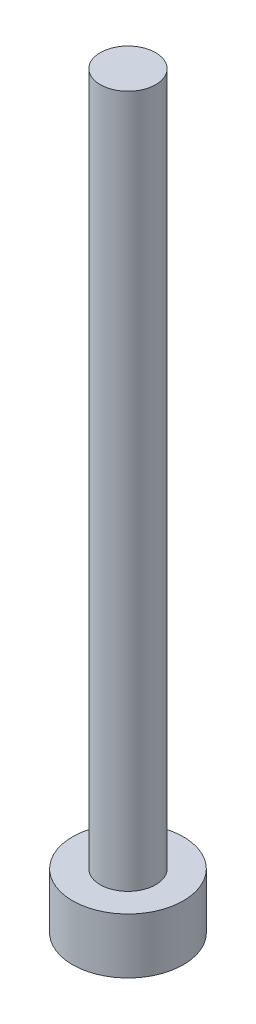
ISO-10303-21;
HEADER;
FILE_DESCRIPTION(('STEP AP214'),'2;1');
FILE_NAME('part.step','',(''),(''),'','','');
FILE_SCHEMA(('AUTOMOTIVE_DESIGN { 1 0 10303 214 1 1 1 1 }'));
ENDSEC;
DATA;
#1=APPLICATION_CONTEXT('core data for automotive mechanical design processes');
#2=APPLICATION_PROTOCOL_DEFINITION('international standard','automotive_design',2000,#1);
#3=PRODUCT_CONTEXT('',#1,'mechanical');
#4=PRODUCT('Part','Part','',(#3));
#5=PRODUCT_RELATED_PRODUCT_CATEGORY('part','',(#4));
#6=PRODUCT_DEFINITION_FORMATION('','',#4);
#7=PRODUCT_DEFINITION_CONTEXT('part definition',#1,'design');
#8=PRODUCT_DEFINITION('design','',#6,#7);
#9=PRODUCT_DEFINITION_SHAPE('','',#8);
#10=(LENGTH_UNIT() NAMED_UNIT(*) SI_UNIT(.MILLI.,.METRE.));
#11=(NAMED_UNIT(*) PLANE_ANGLE_UNIT() SI_UNIT($,.RADIAN.));
#12=(NAMED_UNIT(*) SI_UNIT($,.STERADIAN.) SOLID_ANGLE_UNIT());
#13=UNCERTAINTY_MEASURE_WITH_UNIT(LENGTH_MEASURE(1.E-05),#10,'distance_accuracy_value','');
#14=(GEOMETRIC_REPRESENTATION_CONTEXT(3) GLOBAL_UNCERTAINTY_ASSIGNED_CONTEXT((#13)) GLOBAL_UNIT_ASSIGNED_CONTEXT((#10,
#11,#12)) REPRESENTATION_CONTEXT('',''));
#15=CARTESIAN_POINT('',(0.,0.,0.));
#16=DIRECTION('',(0.,0.,1.));
#17=DIRECTION('',(1.,0.,0.));
#18=AXIS2_PLACEMENT_3D('',#15,#16,#17);
#19=CARTESIAN_POINT('',(-1.99999999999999,54.,0.));
#20=DIRECTION('',(0.,1.,0.));
#21=DIRECTION('',(0.,0.,1.));
#22=AXIS2_PLACEMENT_3D('',#19,#20,#21);
#23=PLANE('',#22);
#24=CARTESIAN_POINT('',(0.,54.,0.));
#25=DIRECTION('',(0.,1.,0.));
#26=DIRECTION('',(0.,0.,1.));
#27=AXIS2_PLACEMENT_3D('',#24,#25,#26);
#28=CIRCLE('',#27,1.99999999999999);
#29=CARTESIAN_POINT('',(0.,54.,1.99999999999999));
#30=VERTEX_POINT('',#29);
#31=EDGE_CURVE('E10',#30,#30,#28,.T.);
#32=ORIENTED_EDGE('',*,*,#31,.T.);
#33=EDGE_LOOP('',(#32));
#34=FACE_BOUND('',#33,.T.);
#35=ADVANCED_FACE('F30',(#34),#23,.T.);
#36=CARTESIAN_POINT('',(0.,49.4323076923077,0.));
#37=DIRECTION('',(0.,1.,0.));
#38=DIRECTION('',(0.,0.,1.));
#39=AXIS2_PLACEMENT_3D('',#36,#37,#38);
#40=CYLINDRICAL_SURFACE('',#39,1.99999999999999);
#41=CARTESIAN_POINT('',(0.,4.,0.));
#42=DIRECTION('',(0.,1.,0.));
#43=DIRECTION('',(0.,0.,1.));
#44=AXIS2_PLACEMENT_3D('',#41,#42,#43);
#45=CIRCLE('',#44,1.99999999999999);
#46=CARTESIAN_POINT('',(0.,4.,1.99999999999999));
#47=VERTEX_POINT('',#46);
#48=EDGE_CURVE('E36',#47,#47,#45,.T.);
#49=ORIENTED_EDGE('',*,*,#48,.T.);
#50=EDGE_LOOP('',(#49));
#51=FACE_BOUND('',#50,.T.);
#52=ORIENTED_EDGE('',*,*,#31,.F.);
#53=EDGE_LOOP('',(#52));
#54=FACE_BOUND('',#53,.T.);
#55=ADVANCED_FACE('F62',(#51,#54),#40,.T.);
#56=CARTESIAN_POINT('',(-3.99999999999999,4.,0.));
#57=DIRECTION('',(0.,1.,0.));
#58=DIRECTION('',(0.,0.,1.));
#59=AXIS2_PLACEMENT_3D('',#56,#57,#58);
#60=PLANE('',#59);
#61=CARTESIAN_POINT('',(0.,4.,0.));
#62=DIRECTION('',(0.,1.,0.));
#63=DIRECTION('',(0.,0.,1.));
#64=AXIS2_PLACEMENT_3D('',#61,#62,#63);
#65=CIRCLE('',#64,3.99999999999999);
#66=CARTESIAN_POINT('',(0.,4.,3.99999999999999));
#67=VERTEX_POINT('',#66);
#68=EDGE_CURVE('E40',#67,#67,#65,.T.);
#69=ORIENTED_EDGE('',*,*,#68,.T.);
#70=EDGE_LOOP('',(#69));
#71=FACE_BOUND('',#70,.T.);
#72=ORIENTED_EDGE('',*,*,#48,.F.);
#73=EDGE_LOOP('',(#72));
#74=FACE_BOUND('',#73,.T.);
#75=ADVANCED_FACE('F59',(#71,#74),#60,.T.);
#76=CARTESIAN_POINT('',(0.,49.4323076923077,0.));
#77=DIRECTION('',(0.,1.,0.));
#78=DIRECTION('',(0.,0.,1.));
#79=AXIS2_PLACEMENT_3D('',#76,#77,#78);
#80=CYLINDRICAL_SURFACE('',#79,3.99999999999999);
#81=CARTESIAN_POINT('',(0.,0.,0.));
#82=DIRECTION('',(0.,1.,0.));
#83=DIRECTION('',(0.,0.,1.));
#84=AXIS2_PLACEMENT_3D('',#81,#82,#83);
#85=CIRCLE('',#84,3.99999999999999);
#86=CARTESIAN_POINT('',(0.,0.,3.99999999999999));
#87=VERTEX_POINT('',#86);
#88=EDGE_CURVE('E44',#87,#87,#85,.T.);
#89=ORIENTED_EDGE('',*,*,#88,.T.);
#90=EDGE_LOOP('',(#89));
#91=FACE_BOUND('',#90,.T.);
#92=ORIENTED_EDGE('',*,*,#68,.F.);
#93=EDGE_LOOP('',(#92));
#94=FACE_BOUND('',#93,.T.);
#95=ADVANCED_FACE('F50',(#91,#94),#80,.T.);
#96=CARTESIAN_POINT('',(0.,0.,0.));
#97=DIRECTION('',(0.,-1.,0.));
#98=DIRECTION('',(0.,0.,-1.));
#99=AXIS2_PLACEMENT_3D('',#96,#97,#98);
#100=PLANE('',#99);
#101=ORIENTED_EDGE('',*,*,#88,.F.);
#102=EDGE_LOOP('',(#101));
#103=FACE_BOUND('',#102,.T.);
#104=ADVANCED_FACE('F53',(#103),#100,.T.);
#105=CLOSED_SHELL('',(#35,#55,#75,#95,#104));
#106=MANIFOLD_SOLID_BREP('B2',#105);
#107=ADVANCED_BREP_SHAPE_REPRESENTATION('',(#18,#106),#14);
#108=SHAPE_DEFINITION_REPRESENTATION(#9,#107);
ENDSEC;
END-ISO-10303-21;
